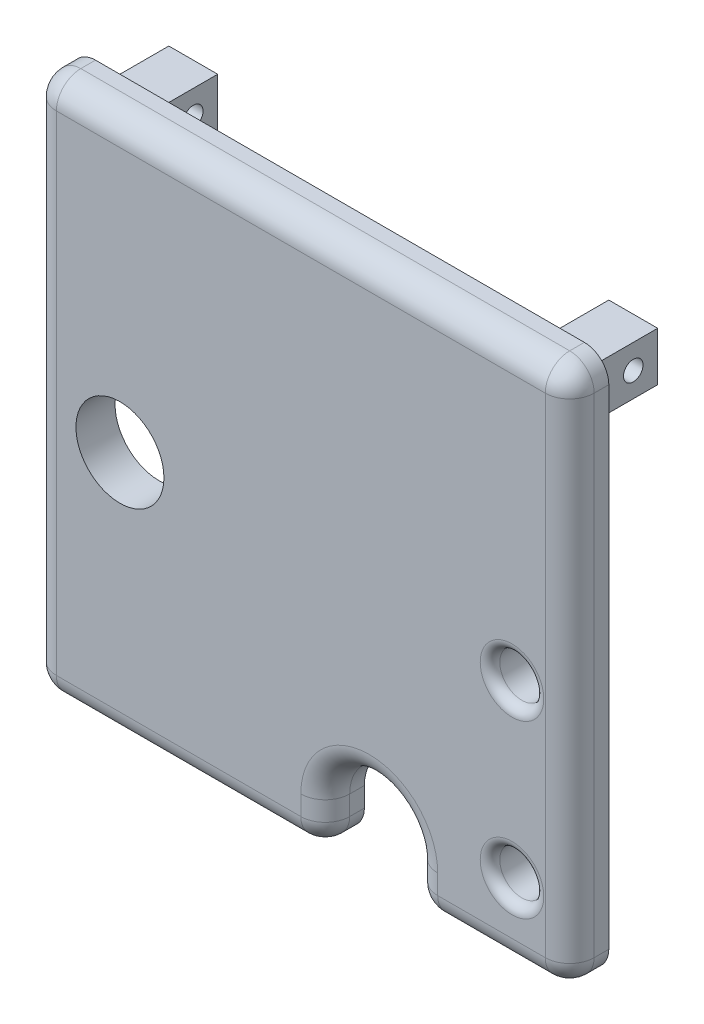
ISO-10303-21;
HEADER;
FILE_DESCRIPTION(('STEP AP214'),'2;1');
FILE_NAME('part.step','',(''),(''),'','','');
FILE_SCHEMA(('AUTOMOTIVE_DESIGN { 1 0 10303 214 1 1 1 1 }'));
ENDSEC;
DATA;
#1=APPLICATION_CONTEXT('core data for automotive mechanical design processes');
#2=APPLICATION_PROTOCOL_DEFINITION('international standard','automotive_design',2000,#1);
#3=PRODUCT_CONTEXT('',#1,'mechanical');
#4=PRODUCT('Part','Part','',(#3));
#5=PRODUCT_RELATED_PRODUCT_CATEGORY('part','',(#4));
#6=PRODUCT_DEFINITION_FORMATION('','',#4);
#7=PRODUCT_DEFINITION_CONTEXT('part definition',#1,'design');
#8=PRODUCT_DEFINITION('design','',#6,#7);
#9=PRODUCT_DEFINITION_SHAPE('','',#8);
#10=(LENGTH_UNIT() NAMED_UNIT(*) SI_UNIT(.MILLI.,.METRE.));
#11=(NAMED_UNIT(*) PLANE_ANGLE_UNIT() SI_UNIT($,.RADIAN.));
#12=(NAMED_UNIT(*) SI_UNIT($,.STERADIAN.) SOLID_ANGLE_UNIT());
#13=UNCERTAINTY_MEASURE_WITH_UNIT(LENGTH_MEASURE(1.E-05),#10,'distance_accuracy_value','');
#14=(GEOMETRIC_REPRESENTATION_CONTEXT(3) GLOBAL_UNCERTAINTY_ASSIGNED_CONTEXT((#13)) GLOBAL_UNIT_ASSIGNED_CONTEXT((#10,
#11,#12)) REPRESENTATION_CONTEXT('',''));
#15=CARTESIAN_POINT('',(0.,0.,0.));
#16=DIRECTION('',(0.,0.,1.));
#17=DIRECTION('',(1.,0.,0.));
#18=AXIS2_PLACEMENT_3D('',#15,#16,#17);
#19=CARTESIAN_POINT('',(43.2,-39.3,-15.));
#20=DIRECTION('',(0.,0.,1.));
#21=DIRECTION('',(1.,0.,0.));
#22=AXIS2_PLACEMENT_3D('',#19,#20,#21);
#23=CYLINDRICAL_SURFACE('',#22,4.5);
#24=CARTESIAN_POINT('',(43.2,-39.3,6.));
#25=DIRECTION('',(0.,0.,-1.));
#26=DIRECTION('',(-1.,0.,0.));
#27=AXIS2_PLACEMENT_3D('',#24,#25,#26);
#28=CIRCLE('',#27,4.5);
#29=CARTESIAN_POINT('',(38.7,-39.3,6.));
#30=VERTEX_POINT('',#29);
#31=EDGE_CURVE('E467',#30,#30,#28,.F.);
#32=ORIENTED_EDGE('',*,*,#31,.T.);
#33=EDGE_LOOP('',(#32));
#34=FACE_BOUND('',#33,.T.);
#35=CARTESIAN_POINT('',(43.2,-39.3,0.));
#36=DIRECTION('',(0.,0.,-1.));
#37=DIRECTION('',(-1.,0.,0.));
#38=AXIS2_PLACEMENT_3D('',#35,#36,#37);
#39=CIRCLE('',#38,4.5);
#40=CARTESIAN_POINT('',(38.7,-39.3,0.));
#41=VERTEX_POINT('',#40);
#42=EDGE_CURVE('E271',#41,#41,#39,.T.);
#43=ORIENTED_EDGE('',*,*,#42,.T.);
#44=EDGE_LOOP('',(#43));
#45=FACE_BOUND('',#44,.T.);
#46=ADVANCED_FACE('F45',(#34,#45),#23,.F.);
#47=CARTESIAN_POINT('',(-55.,-55.,8.));
#48=DIRECTION('',(0.,1.,0.));
#49=DIRECTION('',(0.,0.,1.));
#50=AXIS2_PLACEMENT_3D('',#47,#48,#49);
#51=PLANE('',#50);
#52=DIRECTION('',(1.,0.,0.));
#53=VECTOR('',#52,1.);
#54=CARTESIAN_POINT('',(-55.,-55.,0.));
#55=LINE('',#54,#53);
#56=CARTESIAN_POINT('',(28.,-55.,0.));
#57=VERTEX_POINT('',#56);
#58=CARTESIAN_POINT('',(50.,-55.,0.));
#59=VERTEX_POINT('',#58);
#60=EDGE_CURVE('E423',#57,#59,#55,.T.);
#61=ORIENTED_EDGE('',*,*,#60,.T.);
#62=DIRECTION('',(0.,0.,-1.));
#63=VECTOR('',#62,1.);
#64=CARTESIAN_POINT('',(50.,-55.,8.));
#65=LINE('',#64,#63);
#66=CARTESIAN_POINT('',(50.,-55.,3.));
#67=VERTEX_POINT('',#66);
#68=EDGE_CURVE('E63',#59,#67,#65,.F.);
#69=ORIENTED_EDGE('',*,*,#68,.T.);
#70=DIRECTION('',(1.,0.,0.));
#71=VECTOR('',#70,1.);
#72=CARTESIAN_POINT('',(-55.,-55.,3.));
#73=LINE('',#72,#71);
#74=CARTESIAN_POINT('',(28.,-55.,3.));
#75=VERTEX_POINT('',#74);
#76=EDGE_CURVE('E475',#67,#75,#73,.F.);
#77=ORIENTED_EDGE('',*,*,#76,.T.);
#78=DIRECTION('',(0.,0.,1.));
#79=VECTOR('',#78,1.);
#80=CARTESIAN_POINT('',(28.,-55.,8.));
#81=LINE('',#80,#79);
#82=EDGE_CURVE('E478',#75,#57,#81,.F.);
#83=ORIENTED_EDGE('',*,*,#82,.T.);
#84=EDGE_LOOP('',(#61,#69,#77,#83));
#85=FACE_BOUND('',#84,.T.);
#86=ADVANCED_FACE('F649',(#85),#51,.F.);
#87=CARTESIAN_POINT('',(0.,0.,0.));
#88=DIRECTION('',(0.,0.,-1.));
#89=DIRECTION('',(-1.,0.,0.));
#90=AXIS2_PLACEMENT_3D('',#87,#88,#89);
#91=PLANE('',#90);
#92=ORIENTED_EDGE('',*,*,#42,.F.);
#93=EDGE_LOOP('',(#92));
#94=FACE_BOUND('',#93,.T.);
#95=CARTESIAN_POINT('',(-37.,-4.,0.));
#96=DIRECTION('',(0.,0.,-1.));
#97=DIRECTION('',(-1.,0.,0.));
#98=AXIS2_PLACEMENT_3D('',#95,#96,#97);
#99=CIRCLE('',#98,9.);
#100=CARTESIAN_POINT('',(-46.,-4.,0.));
#101=VERTEX_POINT('',#100);
#102=EDGE_CURVE('E280',#101,#101,#99,.T.);
#103=ORIENTED_EDGE('',*,*,#102,.F.);
#104=EDGE_LOOP('',(#103));
#105=FACE_BOUND('',#104,.T.);
#106=CARTESIAN_POINT('',(-50.,-55.,0.));
#107=VERTEX_POINT('',#106);
#108=CARTESIAN_POINT('',(0.,-55.,0.));
#109=VERTEX_POINT('',#108);
#110=EDGE_CURVE('E424',#107,#109,#55,.T.);
#111=ORIENTED_EDGE('',*,*,#110,.F.);
#112=CARTESIAN_POINT('',(-50.,-50.,0.));
#113=DIRECTION('',(0.,0.,-1.));
#114=DIRECTION('',(-1.,0.,0.));
#115=AXIS2_PLACEMENT_3D('',#112,#113,#114);
#116=CIRCLE('',#115,5.);
#117=CARTESIAN_POINT('',(-55.,-50.,0.));
#118=VERTEX_POINT('',#117);
#119=EDGE_CURVE('E560',#107,#118,#116,.T.);
#120=ORIENTED_EDGE('',*,*,#119,.T.);
#121=DIRECTION('',(0.,-1.,0.));
#122=VECTOR('',#121,1.);
#123=CARTESIAN_POINT('',(-55.,-55.,0.));
#124=LINE('',#123,#122);
#125=CARTESIAN_POINT('',(-55.,50.,0.));
#126=VERTEX_POINT('',#125);
#127=EDGE_CURVE('E419',#126,#118,#124,.T.);
#128=ORIENTED_EDGE('',*,*,#127,.F.);
#129=CARTESIAN_POINT('',(-50.,50.,0.));
#130=DIRECTION('',(0.,0.,-1.));
#131=DIRECTION('',(-1.,0.,0.));
#132=AXIS2_PLACEMENT_3D('',#129,#130,#131);
#133=CIRCLE('',#132,5.);
#134=CARTESIAN_POINT('',(-50.,55.,0.));
#135=VERTEX_POINT('',#134);
#136=EDGE_CURVE('E557',#126,#135,#133,.T.);
#137=ORIENTED_EDGE('',*,*,#136,.T.);
#138=DIRECTION('',(-1.,0.,0.));
#139=VECTOR('',#138,1.);
#140=CARTESIAN_POINT('',(-55.,55.,0.));
#141=LINE('',#140,#139);
#142=CARTESIAN_POINT('',(50.,55.,0.));
#143=VERTEX_POINT('',#142);
#144=EDGE_CURVE('E415',#143,#135,#141,.T.);
#145=ORIENTED_EDGE('',*,*,#144,.F.);
#146=CARTESIAN_POINT('',(50.,50.,0.));
#147=DIRECTION('',(0.,0.,-1.));
#148=DIRECTION('',(-1.,0.,0.));
#149=AXIS2_PLACEMENT_3D('',#146,#147,#148);
#150=CIRCLE('',#149,5.);
#151=CARTESIAN_POINT('',(55.,50.,0.));
#152=VERTEX_POINT('',#151);
#153=EDGE_CURVE('E554',#143,#152,#150,.T.);
#154=ORIENTED_EDGE('',*,*,#153,.T.);
#155=DIRECTION('',(0.,1.,0.));
#156=VECTOR('',#155,1.);
#157=CARTESIAN_POINT('',(55.,-55.,0.));
#158=LINE('',#157,#156);
#159=CARTESIAN_POINT('',(55.,-50.,0.));
#160=VERTEX_POINT('',#159);
#161=EDGE_CURVE('E411',#160,#152,#158,.T.);
#162=ORIENTED_EDGE('',*,*,#161,.F.);
#163=CARTESIAN_POINT('',(50.,-50.,0.));
#164=DIRECTION('',(0.,0.,-1.));
#165=DIRECTION('',(-1.,0.,0.));
#166=AXIS2_PLACEMENT_3D('',#163,#164,#165);
#167=CIRCLE('',#166,5.);
#168=EDGE_CURVE('E551',#160,#59,#167,.T.);
#169=ORIENTED_EDGE('',*,*,#168,.T.);
#170=ORIENTED_EDGE('',*,*,#60,.F.);
#171=CARTESIAN_POINT('',(28.,-50.,0.));
#172=DIRECTION('',(0.,0.,-1.));
#173=DIRECTION('',(-1.,0.,0.));
#174=AXIS2_PLACEMENT_3D('',#171,#172,#173);
#175=CIRCLE('',#174,5.);
#176=CARTESIAN_POINT('',(23.,-50.,0.));
#177=VERTEX_POINT('',#176);
#178=EDGE_CURVE('E484',#57,#177,#175,.T.);
#179=ORIENTED_EDGE('',*,*,#178,.T.);
#180=DIRECTION('',(0.,-1.,0.));
#181=VECTOR('',#180,1.);
#182=CARTESIAN_POINT('',(23.,0.,0.));
#183=LINE('',#182,#181);
#184=CARTESIAN_POINT('',(23.,-46.,0.));
#185=VERTEX_POINT('',#184);
#186=EDGE_CURVE('E260',#185,#177,#183,.T.);
#187=ORIENTED_EDGE('',*,*,#186,.F.);
#188=CARTESIAN_POINT('',(14.,-46.,0.));
#189=DIRECTION('',(0.,0.,-1.));
#190=DIRECTION('',(-1.,0.,0.));
#191=AXIS2_PLACEMENT_3D('',#188,#189,#190);
#192=CIRCLE('',#191,9.);
#193=CARTESIAN_POINT('',(5.00000000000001,-46.,0.));
#194=VERTEX_POINT('',#193);
#195=EDGE_CURVE('E266',#194,#185,#192,.T.);
#196=ORIENTED_EDGE('',*,*,#195,.F.);
#197=DIRECTION('',(0.,1.,0.));
#198=VECTOR('',#197,1.);
#199=CARTESIAN_POINT('',(5.00000000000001,0.,0.));
#200=LINE('',#199,#198);
#201=CARTESIAN_POINT('',(5.00000000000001,-50.,0.));
#202=VERTEX_POINT('',#201);
#203=EDGE_CURVE('E247',#202,#194,#200,.T.);
#204=ORIENTED_EDGE('',*,*,#203,.F.);
#205=CARTESIAN_POINT('',(0.,-50.,0.));
#206=DIRECTION('',(0.,0.,-1.));
#207=DIRECTION('',(-1.,0.,0.));
#208=AXIS2_PLACEMENT_3D('',#205,#206,#207);
#209=CIRCLE('',#208,5.);
#210=EDGE_CURVE('E481',#202,#109,#209,.T.);
#211=ORIENTED_EDGE('',*,*,#210,.T.);
#212=EDGE_LOOP('',(#111,#120,#128,#137,#145,#154,#162,#169,#170,#179,#187,#196,#204,#211));
#213=FACE_BOUND('',#212,.T.);
#214=CARTESIAN_POINT('',(43.2,-4.3,0.));
#215=DIRECTION('',(0.,0.,-1.));
#216=DIRECTION('',(-1.,0.,0.));
#217=AXIS2_PLACEMENT_3D('',#214,#215,#216);
#218=CIRCLE('',#217,4.5);
#219=CARTESIAN_POINT('',(38.7,-4.3,0.));
#220=VERTEX_POINT('',#219);
#221=EDGE_CURVE('E261',#220,#220,#218,.T.);
#222=ORIENTED_EDGE('',*,*,#221,.F.);
#223=EDGE_LOOP('',(#222));
#224=FACE_BOUND('',#223,.T.);
#225=DIRECTION('',(1.,0.,0.));
#226=VECTOR('',#225,1.);
#227=CARTESIAN_POINT('',(50.,50.,0.));
#228=LINE('',#227,#226);
#229=CARTESIAN_POINT('',(40.,50.,0.));
#230=VERTEX_POINT('',#229);
#231=CARTESIAN_POINT('',(50.,50.,0.));
#232=VERTEX_POINT('',#231);
#233=EDGE_CURVE('E389',#230,#232,#228,.T.);
#234=ORIENTED_EDGE('',*,*,#233,.F.);
#235=DIRECTION('',(0.,1.,0.));
#236=VECTOR('',#235,1.);
#237=CARTESIAN_POINT('',(40.,50.,0.));
#238=LINE('',#237,#236);
#239=CARTESIAN_POINT('',(40.,40.,0.));
#240=VERTEX_POINT('',#239);
#241=EDGE_CURVE('E359',#240,#230,#238,.T.);
#242=ORIENTED_EDGE('',*,*,#241,.F.);
#243=DIRECTION('',(-1.,0.,0.));
#244=VECTOR('',#243,1.);
#245=CARTESIAN_POINT('',(50.,40.,0.));
#246=LINE('',#245,#244);
#247=CARTESIAN_POINT('',(50.,40.,0.));
#248=VERTEX_POINT('',#247);
#249=EDGE_CURVE('E376',#248,#240,#246,.T.);
#250=ORIENTED_EDGE('',*,*,#249,.F.);
#251=DIRECTION('',(0.,-1.,0.));
#252=VECTOR('',#251,1.);
#253=CARTESIAN_POINT('',(50.,50.,0.));
#254=LINE('',#253,#252);
#255=EDGE_CURVE('E392',#232,#248,#254,.T.);
#256=ORIENTED_EDGE('',*,*,#255,.F.);
#257=EDGE_LOOP('',(#234,#242,#250,#256));
#258=FACE_BOUND('',#257,.T.);
#259=DIRECTION('',(0.,-1.,0.));
#260=VECTOR('',#259,1.);
#261=CARTESIAN_POINT('',(-40.,50.,0.));
#262=LINE('',#261,#260);
#263=CARTESIAN_POINT('',(-40.,50.,0.));
#264=VERTEX_POINT('',#263);
#265=CARTESIAN_POINT('',(-40.,40.,0.));
#266=VERTEX_POINT('',#265);
#267=EDGE_CURVE('E352',#264,#266,#262,.T.);
#268=ORIENTED_EDGE('',*,*,#267,.F.);
#269=DIRECTION('',(1.,0.,0.));
#270=VECTOR('',#269,1.);
#271=CARTESIAN_POINT('',(-50.,50.,0.));
#272=LINE('',#271,#270);
#273=CARTESIAN_POINT('',(-50.,50.,0.));
#274=VERTEX_POINT('',#273);
#275=EDGE_CURVE('E355',#274,#264,#272,.T.);
#276=ORIENTED_EDGE('',*,*,#275,.F.);
#277=DIRECTION('',(0.,1.,0.));
#278=VECTOR('',#277,1.);
#279=CARTESIAN_POINT('',(-50.,50.,0.));
#280=LINE('',#279,#278);
#281=CARTESIAN_POINT('',(-50.,40.,0.));
#282=VERTEX_POINT('',#281);
#283=EDGE_CURVE('E344',#282,#274,#280,.T.);
#284=ORIENTED_EDGE('',*,*,#283,.F.);
#285=DIRECTION('',(-1.,0.,0.));
#286=VECTOR('',#285,1.);
#287=CARTESIAN_POINT('',(-50.,40.,0.));
#288=LINE('',#287,#286);
#289=EDGE_CURVE('E347',#266,#282,#288,.T.);
#290=ORIENTED_EDGE('',*,*,#289,.F.);
#291=EDGE_LOOP('',(#268,#276,#284,#290));
#292=FACE_BOUND('',#291,.T.);
#293=DIRECTION('',(1.,0.,0.));
#294=VECTOR('',#293,1.);
#295=CARTESIAN_POINT('',(-50.,-40.,0.));
#296=LINE('',#295,#294);
#297=CARTESIAN_POINT('',(-50.,-40.,0.));
#298=VERTEX_POINT('',#297);
#299=CARTESIAN_POINT('',(-40.,-40.,0.));
#300=VERTEX_POINT('',#299);
#301=EDGE_CURVE('E311',#298,#300,#296,.T.);
#302=ORIENTED_EDGE('',*,*,#301,.F.);
#303=DIRECTION('',(0.,1.,0.));
#304=VECTOR('',#303,1.);
#305=CARTESIAN_POINT('',(-50.,-50.,0.));
#306=LINE('',#305,#304);
#307=CARTESIAN_POINT('',(-50.,-50.,0.));
#308=VERTEX_POINT('',#307);
#309=EDGE_CURVE('E314',#308,#298,#306,.T.);
#310=ORIENTED_EDGE('',*,*,#309,.F.);
#311=DIRECTION('',(-1.,0.,0.));
#312=VECTOR('',#311,1.);
#313=CARTESIAN_POINT('',(-50.,-50.,0.));
#314=LINE('',#313,#312);
#315=CARTESIAN_POINT('',(-40.,-50.,0.));
#316=VERTEX_POINT('',#315);
#317=EDGE_CURVE('E303',#316,#308,#314,.T.);
#318=ORIENTED_EDGE('',*,*,#317,.F.);
#319=DIRECTION('',(0.,-1.,0.));
#320=VECTOR('',#319,1.);
#321=CARTESIAN_POINT('',(-40.,-50.,0.));
#322=LINE('',#321,#320);
#323=EDGE_CURVE('E306',#300,#316,#322,.T.);
#324=ORIENTED_EDGE('',*,*,#323,.F.);
#325=EDGE_LOOP('',(#302,#310,#318,#324));
#326=FACE_BOUND('',#325,.T.);
#327=ADVANCED_FACE('F276',(#94,#105,#213,#224,#258,#292,#326),#91,.T.);
#328=CARTESIAN_POINT('',(55.,-55.,8.));
#329=DIRECTION('',(-1.,0.,0.));
#330=DIRECTION('',(0.,0.,1.));
#331=AXIS2_PLACEMENT_3D('',#328,#329,#330);
#332=PLANE('',#331);
#333=ORIENTED_EDGE('',*,*,#161,.T.);
#334=DIRECTION('',(0.,0.,-1.));
#335=VECTOR('',#334,1.);
#336=CARTESIAN_POINT('',(55.,50.,8.));
#337=LINE('',#336,#335);
#338=CARTESIAN_POINT('',(55.,50.,3.));
#339=VERTEX_POINT('',#338);
#340=EDGE_CURVE('E581',#152,#339,#337,.F.);
#341=ORIENTED_EDGE('',*,*,#340,.T.);
#342=DIRECTION('',(0.,1.,0.));
#343=VECTOR('',#342,1.);
#344=CARTESIAN_POINT('',(55.,-55.,3.));
#345=LINE('',#344,#343);
#346=CARTESIAN_POINT('',(55.,-50.,3.));
#347=VERTEX_POINT('',#346);
#348=EDGE_CURVE('E521',#339,#347,#345,.F.);
#349=ORIENTED_EDGE('',*,*,#348,.T.);
#350=DIRECTION('',(0.,0.,-1.));
#351=VECTOR('',#350,1.);
#352=CARTESIAN_POINT('',(55.,-50.,8.));
#353=LINE('',#352,#351);
#354=EDGE_CURVE('E577',#347,#160,#353,.T.);
#355=ORIENTED_EDGE('',*,*,#354,.T.);
#356=EDGE_LOOP('',(#333,#341,#349,#355));
#357=FACE_BOUND('',#356,.T.);
#358=ADVANCED_FACE('F648',(#357),#332,.F.);
#359=CARTESIAN_POINT('',(-55.,55.,8.));
#360=DIRECTION('',(0.,-1.,0.));
#361=DIRECTION('',(0.,0.,-1.));
#362=AXIS2_PLACEMENT_3D('',#359,#360,#361);
#363=PLANE('',#362);
#364=ORIENTED_EDGE('',*,*,#144,.T.);
#365=DIRECTION('',(0.,0.,-1.));
#366=VECTOR('',#365,1.);
#367=CARTESIAN_POINT('',(-50.,55.,8.));
#368=LINE('',#367,#366);
#369=CARTESIAN_POINT('',(-50.,55.,3.));
#370=VERTEX_POINT('',#369);
#371=EDGE_CURVE('E574',#135,#370,#368,.F.);
#372=ORIENTED_EDGE('',*,*,#371,.T.);
#373=DIRECTION('',(-1.,0.,0.));
#374=VECTOR('',#373,1.);
#375=CARTESIAN_POINT('',(-55.,55.,3.));
#376=LINE('',#375,#374);
#377=CARTESIAN_POINT('',(50.,55.,3.));
#378=VERTEX_POINT('',#377);
#379=EDGE_CURVE('E524',#370,#378,#376,.F.);
#380=ORIENTED_EDGE('',*,*,#379,.T.);
#381=DIRECTION('',(0.,0.,-1.));
#382=VECTOR('',#381,1.);
#383=CARTESIAN_POINT('',(50.,55.,8.));
#384=LINE('',#383,#382);
#385=EDGE_CURVE('E570',#378,#143,#384,.T.);
#386=ORIENTED_EDGE('',*,*,#385,.T.);
#387=EDGE_LOOP('',(#364,#372,#380,#386));
#388=FACE_BOUND('',#387,.T.);
#389=ADVANCED_FACE('F779',(#388),#363,.F.);
#390=CARTESIAN_POINT('',(-55.,-55.,8.));
#391=DIRECTION('',(1.,0.,0.));
#392=DIRECTION('',(0.,0.,-1.));
#393=AXIS2_PLACEMENT_3D('',#390,#391,#392);
#394=PLANE('',#393);
#395=ORIENTED_EDGE('',*,*,#127,.T.);
#396=DIRECTION('',(0.,0.,-1.));
#397=VECTOR('',#396,1.);
#398=CARTESIAN_POINT('',(-55.,-50.,8.));
#399=LINE('',#398,#397);
#400=CARTESIAN_POINT('',(-55.,-50.,3.));
#401=VERTEX_POINT('',#400);
#402=EDGE_CURVE('E567',#118,#401,#399,.F.);
#403=ORIENTED_EDGE('',*,*,#402,.T.);
#404=DIRECTION('',(0.,-1.,0.));
#405=VECTOR('',#404,1.);
#406=CARTESIAN_POINT('',(-55.,-55.,3.));
#407=LINE('',#406,#405);
#408=CARTESIAN_POINT('',(-55.,50.,3.));
#409=VERTEX_POINT('',#408);
#410=EDGE_CURVE('E528',#401,#409,#407,.F.);
#411=ORIENTED_EDGE('',*,*,#410,.T.);
#412=DIRECTION('',(0.,0.,-1.));
#413=VECTOR('',#412,1.);
#414=CARTESIAN_POINT('',(-55.,50.,8.));
#415=LINE('',#414,#413);
#416=EDGE_CURVE('E563',#409,#126,#415,.T.);
#417=ORIENTED_EDGE('',*,*,#416,.T.);
#418=EDGE_LOOP('',(#395,#403,#411,#417));
#419=FACE_BOUND('',#418,.T.);
#420=ADVANCED_FACE('F787',(#419),#394,.F.);
#421=DIRECTION('',(1.,0.,0.));
#422=VECTOR('',#421,1.);
#423=CARTESIAN_POINT('',(-55.,-55.,3.));
#424=LINE('',#423,#422);
#425=CARTESIAN_POINT('',(0.,-55.,3.));
#426=VERTEX_POINT('',#425);
#427=CARTESIAN_POINT('',(-50.,-55.,3.));
#428=VERTEX_POINT('',#427);
#429=EDGE_CURVE('E490',#426,#428,#424,.F.);
#430=ORIENTED_EDGE('',*,*,#429,.T.);
#431=DIRECTION('',(0.,0.,-1.));
#432=VECTOR('',#431,1.);
#433=CARTESIAN_POINT('',(-50.,-55.,8.));
#434=LINE('',#433,#432);
#435=EDGE_CURVE('E532',#428,#107,#434,.T.);
#436=ORIENTED_EDGE('',*,*,#435,.T.);
#437=ORIENTED_EDGE('',*,*,#110,.T.);
#438=DIRECTION('',(0.,0.,1.));
#439=VECTOR('',#438,1.);
#440=CARTESIAN_POINT('',(0.,-55.,8.));
#441=LINE('',#440,#439);
#442=EDGE_CURVE('E494',#109,#426,#441,.T.);
#443=ORIENTED_EDGE('',*,*,#442,.T.);
#444=EDGE_LOOP('',(#430,#436,#437,#443));
#445=FACE_BOUND('',#444,.T.);
#446=ADVANCED_FACE('F697',(#445),#51,.F.);
#447=CARTESIAN_POINT('',(0.,0.,8.));
#448=DIRECTION('',(0.,0.,-1.));
#449=DIRECTION('',(-1.,0.,0.));
#450=AXIS2_PLACEMENT_3D('',#447,#448,#449);
#451=PLANE('',#450);
#452=CARTESIAN_POINT('',(43.2,-4.3,8.));
#453=DIRECTION('',(0.,0.,-1.));
#454=DIRECTION('',(-1.,0.,0.));
#455=AXIS2_PLACEMENT_3D('',#452,#453,#454);
#456=CIRCLE('',#455,6.5);
#457=CARTESIAN_POINT('',(36.7,-4.3,8.));
#458=VERTEX_POINT('',#457);
#459=EDGE_CURVE('E463',#458,#458,#456,.T.);
#460=ORIENTED_EDGE('',*,*,#459,.T.);
#461=EDGE_LOOP('',(#460));
#462=FACE_BOUND('',#461,.T.);
#463=CARTESIAN_POINT('',(43.2,-39.3,8.));
#464=DIRECTION('',(0.,0.,-1.));
#465=DIRECTION('',(-1.,0.,0.));
#466=AXIS2_PLACEMENT_3D('',#463,#464,#465);
#467=CIRCLE('',#466,6.5);
#468=CARTESIAN_POINT('',(36.7,-39.3,8.));
#469=VERTEX_POINT('',#468);
#470=EDGE_CURVE('E459',#469,#469,#467,.T.);
#471=ORIENTED_EDGE('',*,*,#470,.T.);
#472=EDGE_LOOP('',(#471));
#473=FACE_BOUND('',#472,.T.);
#474=CARTESIAN_POINT('',(-37.,-4.,8.));
#475=DIRECTION('',(0.,0.,1.));
#476=DIRECTION('',(1.,0.,0.));
#477=AXIS2_PLACEMENT_3D('',#474,#475,#476);
#478=CIRCLE('',#477,9.);
#479=CARTESIAN_POINT('',(-28.,-4.,8.));
#480=VERTEX_POINT('',#479);
#481=EDGE_CURVE('E455',#480,#480,#478,.T.);
#482=ORIENTED_EDGE('',*,*,#481,.F.);
#483=EDGE_LOOP('',(#482));
#484=FACE_BOUND('',#483,.T.);
#485=DIRECTION('',(0.,1.,0.));
#486=VECTOR('',#485,1.);
#487=CARTESIAN_POINT('',(28.,0.,8.));
#488=LINE('',#487,#486);
#489=CARTESIAN_POINT('',(28.,-46.,8.));
#490=VERTEX_POINT('',#489);
#491=CARTESIAN_POINT('',(28.,-50.,8.));
#492=VERTEX_POINT('',#491);
#493=EDGE_CURVE('E430',#490,#492,#488,.F.);
#494=ORIENTED_EDGE('',*,*,#493,.T.);
#495=DIRECTION('',(1.,0.,0.));
#496=VECTOR('',#495,1.);
#497=CARTESIAN_POINT('',(0.,-50.,8.));
#498=LINE('',#497,#496);
#499=CARTESIAN_POINT('',(50.,-50.,8.));
#500=VERTEX_POINT('',#499);
#501=EDGE_CURVE('E517',#492,#500,#498,.T.);
#502=ORIENTED_EDGE('',*,*,#501,.T.);
#503=DIRECTION('',(0.,1.,0.));
#504=VECTOR('',#503,1.);
#505=CARTESIAN_POINT('',(50.,0.,8.));
#506=LINE('',#505,#504);
#507=CARTESIAN_POINT('',(50.,50.,8.));
#508=VERTEX_POINT('',#507);
#509=EDGE_CURVE('E513',#500,#508,#506,.T.);
#510=ORIENTED_EDGE('',*,*,#509,.T.);
#511=DIRECTION('',(-1.,0.,0.));
#512=VECTOR('',#511,1.);
#513=CARTESIAN_POINT('',(0.,50.,8.));
#514=LINE('',#513,#512);
#515=CARTESIAN_POINT('',(-50.,50.,8.));
#516=VERTEX_POINT('',#515);
#517=EDGE_CURVE('E509',#508,#516,#514,.T.);
#518=ORIENTED_EDGE('',*,*,#517,.T.);
#519=DIRECTION('',(0.,-1.,0.));
#520=VECTOR('',#519,1.);
#521=CARTESIAN_POINT('',(-50.,0.,8.));
#522=LINE('',#521,#520);
#523=CARTESIAN_POINT('',(-50.,-50.,8.));
#524=VERTEX_POINT('',#523);
#525=EDGE_CURVE('E505',#516,#524,#522,.T.);
#526=ORIENTED_EDGE('',*,*,#525,.T.);
#527=DIRECTION('',(1.,0.,0.));
#528=VECTOR('',#527,1.);
#529=CARTESIAN_POINT('',(0.,-50.,8.));
#530=LINE('',#529,#528);
#531=CARTESIAN_POINT('',(0.,-50.,8.));
#532=VERTEX_POINT('',#531);
#533=EDGE_CURVE('E502',#524,#532,#530,.T.);
#534=ORIENTED_EDGE('',*,*,#533,.T.);
#535=DIRECTION('',(0.,-1.,0.));
#536=VECTOR('',#535,1.);
#537=CARTESIAN_POINT('',(0.,0.,8.));
#538=LINE('',#537,#536);
#539=CARTESIAN_POINT('',(0.,-46.,8.));
#540=VERTEX_POINT('',#539);
#541=EDGE_CURVE('E437',#532,#540,#538,.F.);
#542=ORIENTED_EDGE('',*,*,#541,.T.);
#543=CARTESIAN_POINT('',(14.,-46.,8.));
#544=DIRECTION('',(0.,0.,-1.));
#545=DIRECTION('',(-1.,0.,0.));
#546=AXIS2_PLACEMENT_3D('',#543,#544,#545);
#547=CIRCLE('',#546,14.);
#548=EDGE_CURVE('E434',#540,#490,#547,.T.);
#549=ORIENTED_EDGE('',*,*,#548,.T.);
#550=EDGE_LOOP('',(#494,#502,#510,#518,#526,#534,#542,#549));
#551=FACE_BOUND('',#550,.T.);
#552=ADVANCED_FACE('F802',(#462,#473,#484,#551),#451,.F.);
#553=CARTESIAN_POINT('',(40.,50.,-15.));
#554=DIRECTION('',(1.,0.,0.));
#555=DIRECTION('',(0.,0.,-1.));
#556=AXIS2_PLACEMENT_3D('',#553,#554,#555);
#557=PLANE('',#556);
#558=CARTESIAN_POINT('',(40.,45.,-10.));
#559=DIRECTION('',(1.,0.,0.));
#560=DIRECTION('',(0.,0.,-1.));
#561=AXIS2_PLACEMENT_3D('',#558,#559,#560);
#562=CIRCLE('',#561,2.);
#563=CARTESIAN_POINT('',(40.,45.,-12.));
#564=VERTEX_POINT('',#563);
#565=EDGE_CURVE('E618',#564,#564,#562,.T.);
#566=ORIENTED_EDGE('',*,*,#565,.T.);
#567=EDGE_LOOP('',(#566));
#568=FACE_BOUND('',#567,.T.);
#569=ORIENTED_EDGE('',*,*,#241,.T.);
#570=DIRECTION('',(0.,0.,1.));
#571=VECTOR('',#570,1.);
#572=CARTESIAN_POINT('',(40.,50.,-15.));
#573=LINE('',#572,#571);
#574=CARTESIAN_POINT('',(40.,50.,-15.));
#575=VERTEX_POINT('',#574);
#576=EDGE_CURVE('E408',#575,#230,#573,.T.);
#577=ORIENTED_EDGE('',*,*,#576,.F.);
#578=DIRECTION('',(0.,1.,0.));
#579=VECTOR('',#578,1.);
#580=CARTESIAN_POINT('',(40.,50.,-15.));
#581=LINE('',#580,#579);
#582=CARTESIAN_POINT('',(40.,40.,-15.));
#583=VERTEX_POINT('',#582);
#584=EDGE_CURVE('E371',#583,#575,#581,.T.);
#585=ORIENTED_EDGE('',*,*,#584,.F.);
#586=DIRECTION('',(0.,0.,1.));
#587=VECTOR('',#586,1.);
#588=CARTESIAN_POINT('',(40.,40.,-15.));
#589=LINE('',#588,#587);
#590=EDGE_CURVE('E385',#583,#240,#589,.T.);
#591=ORIENTED_EDGE('',*,*,#590,.T.);
#592=EDGE_LOOP('',(#569,#577,#585,#591));
#593=FACE_BOUND('',#592,.T.);
#594=ADVANCED_FACE('F809',(#568,#593),#557,.F.);
#595=CARTESIAN_POINT('',(50.,50.,-15.));
#596=DIRECTION('',(0.,-1.,0.));
#597=DIRECTION('',(0.,0.,-1.));
#598=AXIS2_PLACEMENT_3D('',#595,#596,#597);
#599=PLANE('',#598);
#600=ORIENTED_EDGE('',*,*,#233,.T.);
#601=DIRECTION('',(0.,0.,1.));
#602=VECTOR('',#601,1.);
#603=CARTESIAN_POINT('',(50.,50.,-15.));
#604=LINE('',#603,#602);
#605=CARTESIAN_POINT('',(50.,50.,-15.));
#606=VERTEX_POINT('',#605);
#607=EDGE_CURVE('E404',#606,#232,#604,.T.);
#608=ORIENTED_EDGE('',*,*,#607,.F.);
#609=DIRECTION('',(1.,0.,0.));
#610=VECTOR('',#609,1.);
#611=CARTESIAN_POINT('',(50.,50.,-15.));
#612=LINE('',#611,#610);
#613=EDGE_CURVE('E375',#575,#606,#612,.T.);
#614=ORIENTED_EDGE('',*,*,#613,.F.);
#615=ORIENTED_EDGE('',*,*,#576,.T.);
#616=EDGE_LOOP('',(#600,#608,#614,#615));
#617=FACE_BOUND('',#616,.T.);
#618=ADVANCED_FACE('F818',(#617),#599,.F.);
#619=CARTESIAN_POINT('',(50.,50.,-15.));
#620=DIRECTION('',(-1.,0.,0.));
#621=DIRECTION('',(0.,0.,1.));
#622=AXIS2_PLACEMENT_3D('',#619,#620,#621);
#623=PLANE('',#622);
#624=CARTESIAN_POINT('',(50.,45.,-10.));
#625=DIRECTION('',(1.,0.,0.));
#626=DIRECTION('',(0.,0.,-1.));
#627=AXIS2_PLACEMENT_3D('',#624,#625,#626);
#628=CIRCLE('',#627,2.);
#629=CARTESIAN_POINT('',(50.,45.,-12.));
#630=VERTEX_POINT('',#629);
#631=EDGE_CURVE('E1379',#630,#630,#628,.T.);
#632=ORIENTED_EDGE('',*,*,#631,.F.);
#633=EDGE_LOOP('',(#632));
#634=FACE_BOUND('',#633,.T.);
#635=ORIENTED_EDGE('',*,*,#255,.T.);
#636=DIRECTION('',(0.,0.,1.));
#637=VECTOR('',#636,1.);
#638=CARTESIAN_POINT('',(50.,40.,-15.));
#639=LINE('',#638,#637);
#640=CARTESIAN_POINT('',(50.,40.,-15.));
#641=VERTEX_POINT('',#640);
#642=EDGE_CURVE('E401',#641,#248,#639,.T.);
#643=ORIENTED_EDGE('',*,*,#642,.F.);
#644=DIRECTION('',(0.,-1.,0.));
#645=VECTOR('',#644,1.);
#646=CARTESIAN_POINT('',(50.,50.,-15.));
#647=LINE('',#646,#645);
#648=EDGE_CURVE('E379',#606,#641,#647,.T.);
#649=ORIENTED_EDGE('',*,*,#648,.F.);
#650=ORIENTED_EDGE('',*,*,#607,.T.);
#651=EDGE_LOOP('',(#635,#643,#649,#650));
#652=FACE_BOUND('',#651,.T.);
#653=ADVANCED_FACE('F827',(#634,#652),#623,.F.);
#654=CARTESIAN_POINT('',(50.,40.,-15.));
#655=DIRECTION('',(0.,1.,0.));
#656=DIRECTION('',(0.,0.,1.));
#657=AXIS2_PLACEMENT_3D('',#654,#655,#656);
#658=PLANE('',#657);
#659=ORIENTED_EDGE('',*,*,#249,.T.);
#660=ORIENTED_EDGE('',*,*,#590,.F.);
#661=DIRECTION('',(-1.,0.,0.));
#662=VECTOR('',#661,1.);
#663=CARTESIAN_POINT('',(50.,40.,-15.));
#664=LINE('',#663,#662);
#665=EDGE_CURVE('E382',#641,#583,#664,.T.);
#666=ORIENTED_EDGE('',*,*,#665,.F.);
#667=ORIENTED_EDGE('',*,*,#642,.T.);
#668=EDGE_LOOP('',(#659,#660,#666,#667));
#669=FACE_BOUND('',#668,.T.);
#670=ADVANCED_FACE('F835',(#669),#658,.F.);
#671=CARTESIAN_POINT('',(0.,0.,-15.));
#672=DIRECTION('',(0.,0.,-1.));
#673=DIRECTION('',(-1.,0.,0.));
#674=AXIS2_PLACEMENT_3D('',#671,#672,#673);
#675=PLANE('',#674);
#676=ORIENTED_EDGE('',*,*,#584,.T.);
#677=ORIENTED_EDGE('',*,*,#613,.T.);
#678=ORIENTED_EDGE('',*,*,#648,.T.);
#679=ORIENTED_EDGE('',*,*,#665,.T.);
#680=EDGE_LOOP('',(#676,#677,#678,#679));
#681=FACE_BOUND('',#680,.T.);
#682=ADVANCED_FACE('F843',(#681),#675,.T.);
#683=CARTESIAN_POINT('',(-50.,50.,-15.));
#684=DIRECTION('',(0.,-1.,0.));
#685=DIRECTION('',(0.,0.,-1.));
#686=AXIS2_PLACEMENT_3D('',#683,#684,#685);
#687=PLANE('',#686);
#688=ORIENTED_EDGE('',*,*,#275,.T.);
#689=DIRECTION('',(0.,0.,1.));
#690=VECTOR('',#689,1.);
#691=CARTESIAN_POINT('',(-40.,50.,-15.));
#692=LINE('',#691,#690);
#693=CARTESIAN_POINT('',(-40.,50.,-15.));
#694=VERTEX_POINT('',#693);
#695=EDGE_CURVE('E318',#694,#264,#692,.T.);
#696=ORIENTED_EDGE('',*,*,#695,.F.);
#697=DIRECTION('',(1.,0.,0.));
#698=VECTOR('',#697,1.);
#699=CARTESIAN_POINT('',(-50.,50.,-15.));
#700=LINE('',#699,#698);
#701=CARTESIAN_POINT('',(-50.,50.,-15.));
#702=VERTEX_POINT('',#701);
#703=EDGE_CURVE('E348',#702,#694,#700,.T.);
#704=ORIENTED_EDGE('',*,*,#703,.F.);
#705=DIRECTION('',(0.,0.,1.));
#706=VECTOR('',#705,1.);
#707=CARTESIAN_POINT('',(-50.,50.,-15.));
#708=LINE('',#707,#706);
#709=EDGE_CURVE('E339',#702,#274,#708,.T.);
#710=ORIENTED_EDGE('',*,*,#709,.T.);
#711=EDGE_LOOP('',(#688,#696,#704,#710));
#712=FACE_BOUND('',#711,.T.);
#713=ADVANCED_FACE('F851',(#712),#687,.F.);
#714=CARTESIAN_POINT('',(-40.,50.,-15.));
#715=DIRECTION('',(-1.,0.,0.));
#716=DIRECTION('',(0.,0.,1.));
#717=AXIS2_PLACEMENT_3D('',#714,#715,#716);
#718=PLANE('',#717);
#719=CARTESIAN_POINT('',(-40.,45.,-10.));
#720=DIRECTION('',(-1.,0.,0.));
#721=DIRECTION('',(0.,0.,1.));
#722=AXIS2_PLACEMENT_3D('',#719,#720,#721);
#723=CIRCLE('',#722,2.);
#724=CARTESIAN_POINT('',(-40.,45.,-8.));
#725=VERTEX_POINT('',#724);
#726=EDGE_CURVE('E624',#725,#725,#723,.T.);
#727=ORIENTED_EDGE('',*,*,#726,.T.);
#728=EDGE_LOOP('',(#727));
#729=FACE_BOUND('',#728,.T.);
#730=ORIENTED_EDGE('',*,*,#267,.T.);
#731=DIRECTION('',(0.,0.,1.));
#732=VECTOR('',#731,1.);
#733=CARTESIAN_POINT('',(-40.,40.,-15.));
#734=LINE('',#733,#732);
#735=CARTESIAN_POINT('',(-40.,40.,-15.));
#736=VERTEX_POINT('',#735);
#737=EDGE_CURVE('E332',#736,#266,#734,.T.);
#738=ORIENTED_EDGE('',*,*,#737,.F.);
#739=DIRECTION('',(0.,-1.,0.));
#740=VECTOR('',#739,1.);
#741=CARTESIAN_POINT('',(-40.,50.,-15.));
#742=LINE('',#741,#740);
#743=EDGE_CURVE('E365',#694,#736,#742,.T.);
#744=ORIENTED_EDGE('',*,*,#743,.F.);
#745=ORIENTED_EDGE('',*,*,#695,.T.);
#746=EDGE_LOOP('',(#730,#738,#744,#745));
#747=FACE_BOUND('',#746,.T.);
#748=ADVANCED_FACE('F859',(#729,#747),#718,.F.);
#749=CARTESIAN_POINT('',(-50.,40.,-15.));
#750=DIRECTION('',(0.,1.,0.));
#751=DIRECTION('',(0.,0.,1.));
#752=AXIS2_PLACEMENT_3D('',#749,#750,#751);
#753=PLANE('',#752);
#754=ORIENTED_EDGE('',*,*,#289,.T.);
#755=DIRECTION('',(0.,0.,1.));
#756=VECTOR('',#755,1.);
#757=CARTESIAN_POINT('',(-50.,40.,-15.));
#758=LINE('',#757,#756);
#759=CARTESIAN_POINT('',(-50.,40.,-15.));
#760=VERTEX_POINT('',#759);
#761=EDGE_CURVE('E336',#760,#282,#758,.T.);
#762=ORIENTED_EDGE('',*,*,#761,.F.);
#763=DIRECTION('',(-1.,0.,0.));
#764=VECTOR('',#763,1.);
#765=CARTESIAN_POINT('',(-50.,40.,-15.));
#766=LINE('',#765,#764);
#767=EDGE_CURVE('E362',#736,#760,#766,.T.);
#768=ORIENTED_EDGE('',*,*,#767,.F.);
#769=ORIENTED_EDGE('',*,*,#737,.T.);
#770=EDGE_LOOP('',(#754,#762,#768,#769));
#771=FACE_BOUND('',#770,.T.);
#772=ADVANCED_FACE('F867',(#771),#753,.F.);
#773=CARTESIAN_POINT('',(-50.,50.,-15.));
#774=DIRECTION('',(1.,0.,0.));
#775=DIRECTION('',(0.,0.,-1.));
#776=AXIS2_PLACEMENT_3D('',#773,#774,#775);
#777=PLANE('',#776);
#778=CARTESIAN_POINT('',(-50.,45.,-10.));
#779=DIRECTION('',(1.,0.,0.));
#780=DIRECTION('',(0.,0.,-1.));
#781=AXIS2_PLACEMENT_3D('',#778,#779,#780);
#782=CIRCLE('',#781,2.);
#783=CARTESIAN_POINT('',(-50.,45.,-12.));
#784=VERTEX_POINT('',#783);
#785=EDGE_CURVE('E49',#784,#784,#782,.T.);
#786=ORIENTED_EDGE('',*,*,#785,.T.);
#787=EDGE_LOOP('',(#786));
#788=FACE_BOUND('',#787,.T.);
#789=ORIENTED_EDGE('',*,*,#283,.T.);
#790=ORIENTED_EDGE('',*,*,#709,.F.);
#791=DIRECTION('',(0.,1.,0.));
#792=VECTOR('',#791,1.);
#793=CARTESIAN_POINT('',(-50.,50.,-15.));
#794=LINE('',#793,#792);
#795=EDGE_CURVE('E343',#760,#702,#794,.T.);
#796=ORIENTED_EDGE('',*,*,#795,.F.);
#797=ORIENTED_EDGE('',*,*,#761,.T.);
#798=EDGE_LOOP('',(#789,#790,#796,#797));
#799=FACE_BOUND('',#798,.T.);
#800=ADVANCED_FACE('F874',(#788,#799),#777,.F.);
#801=CARTESIAN_POINT('',(0.,0.,-15.));
#802=DIRECTION('',(0.,0.,-1.));
#803=DIRECTION('',(-1.,0.,0.));
#804=AXIS2_PLACEMENT_3D('',#801,#802,#803);
#805=PLANE('',#804);
#806=ORIENTED_EDGE('',*,*,#703,.T.);
#807=ORIENTED_EDGE('',*,*,#743,.T.);
#808=ORIENTED_EDGE('',*,*,#767,.T.);
#809=ORIENTED_EDGE('',*,*,#795,.T.);
#810=EDGE_LOOP('',(#806,#807,#808,#809));
#811=FACE_BOUND('',#810,.T.);
#812=ADVANCED_FACE('F705',(#811),#805,.T.);
#813=CARTESIAN_POINT('',(-50.,-50.,-15.));
#814=DIRECTION('',(1.,0.,0.));
#815=DIRECTION('',(0.,0.,-1.));
#816=AXIS2_PLACEMENT_3D('',#813,#814,#815);
#817=PLANE('',#816);
#818=CARTESIAN_POINT('',(-50.,-45.,-10.));
#819=DIRECTION('',(1.,0.,0.));
#820=DIRECTION('',(0.,0.,-1.));
#821=AXIS2_PLACEMENT_3D('',#818,#819,#820);
#822=CIRCLE('',#821,2.);
#823=CARTESIAN_POINT('',(-50.,-45.,-12.));
#824=VERTEX_POINT('',#823);
#825=EDGE_CURVE('E1372',#824,#824,#822,.T.);
#826=ORIENTED_EDGE('',*,*,#825,.T.);
#827=EDGE_LOOP('',(#826));
#828=FACE_BOUND('',#827,.T.);
#829=ORIENTED_EDGE('',*,*,#309,.T.);
#830=DIRECTION('',(0.,0.,1.));
#831=VECTOR('',#830,1.);
#832=CARTESIAN_POINT('',(-50.,-40.,-15.));
#833=LINE('',#832,#831);
#834=CARTESIAN_POINT('',(-50.,-40.,-15.));
#835=VERTEX_POINT('',#834);
#836=EDGE_CURVE('E285',#835,#298,#833,.T.);
#837=ORIENTED_EDGE('',*,*,#836,.F.);
#838=DIRECTION('',(0.,1.,0.));
#839=VECTOR('',#838,1.);
#840=CARTESIAN_POINT('',(-50.,-50.,-15.));
#841=LINE('',#840,#839);
#842=CARTESIAN_POINT('',(-50.,-50.,-15.));
#843=VERTEX_POINT('',#842);
#844=EDGE_CURVE('E307',#843,#835,#841,.T.);
#845=ORIENTED_EDGE('',*,*,#844,.F.);
#846=DIRECTION('',(0.,0.,1.));
#847=VECTOR('',#846,1.);
#848=CARTESIAN_POINT('',(-50.,-50.,-15.));
#849=LINE('',#848,#847);
#850=EDGE_CURVE('E298',#843,#308,#849,.T.);
#851=ORIENTED_EDGE('',*,*,#850,.T.);
#852=EDGE_LOOP('',(#829,#837,#845,#851));
#853=FACE_BOUND('',#852,.T.);
#854=ADVANCED_FACE('F678',(#828,#853),#817,.F.);
#855=CARTESIAN_POINT('',(-50.,-40.,-15.));
#856=DIRECTION('',(0.,-1.,0.));
#857=DIRECTION('',(0.,0.,-1.));
#858=AXIS2_PLACEMENT_3D('',#855,#856,#857);
#859=PLANE('',#858);
#860=ORIENTED_EDGE('',*,*,#301,.T.);
#861=DIRECTION('',(0.,0.,1.));
#862=VECTOR('',#861,1.);
#863=CARTESIAN_POINT('',(-40.,-40.,-15.));
#864=LINE('',#863,#862);
#865=CARTESIAN_POINT('',(-40.,-40.,-15.));
#866=VERTEX_POINT('',#865);
#867=EDGE_CURVE('E291',#866,#300,#864,.T.);
#868=ORIENTED_EDGE('',*,*,#867,.F.);
#869=DIRECTION('',(1.,0.,0.));
#870=VECTOR('',#869,1.);
#871=CARTESIAN_POINT('',(-50.,-40.,-15.));
#872=LINE('',#871,#870);
#873=EDGE_CURVE('E324',#835,#866,#872,.T.);
#874=ORIENTED_EDGE('',*,*,#873,.F.);
#875=ORIENTED_EDGE('',*,*,#836,.T.);
#876=EDGE_LOOP('',(#860,#868,#874,#875));
#877=FACE_BOUND('',#876,.T.);
#878=ADVANCED_FACE('F666',(#877),#859,.F.);
#879=CARTESIAN_POINT('',(-40.,-50.,-15.));
#880=DIRECTION('',(-1.,0.,0.));
#881=DIRECTION('',(0.,0.,1.));
#882=AXIS2_PLACEMENT_3D('',#879,#880,#881);
#883=PLANE('',#882);
#884=CARTESIAN_POINT('',(-40.,-45.,-10.));
#885=DIRECTION('',(-1.,0.,0.));
#886=DIRECTION('',(0.,0.,1.));
#887=AXIS2_PLACEMENT_3D('',#884,#885,#886);
#888=CIRCLE('',#887,2.);
#889=CARTESIAN_POINT('',(-40.,-45.,-8.));
#890=VERTEX_POINT('',#889);
#891=EDGE_CURVE('E1375',#890,#890,#888,.T.);
#892=ORIENTED_EDGE('',*,*,#891,.T.);
#893=EDGE_LOOP('',(#892));
#894=FACE_BOUND('',#893,.T.);
#895=ORIENTED_EDGE('',*,*,#323,.T.);
#896=DIRECTION('',(0.,0.,1.));
#897=VECTOR('',#896,1.);
#898=CARTESIAN_POINT('',(-40.,-50.,-15.));
#899=LINE('',#898,#897);
#900=CARTESIAN_POINT('',(-40.,-50.,-15.));
#901=VERTEX_POINT('',#900);
#902=EDGE_CURVE('E295',#901,#316,#899,.T.);
#903=ORIENTED_EDGE('',*,*,#902,.F.);
#904=DIRECTION('',(0.,-1.,0.));
#905=VECTOR('',#904,1.);
#906=CARTESIAN_POINT('',(-40.,-50.,-15.));
#907=LINE('',#906,#905);
#908=EDGE_CURVE('E321',#866,#901,#907,.T.);
#909=ORIENTED_EDGE('',*,*,#908,.F.);
#910=ORIENTED_EDGE('',*,*,#867,.T.);
#911=EDGE_LOOP('',(#895,#903,#909,#910));
#912=FACE_BOUND('',#911,.T.);
#913=ADVANCED_FACE('F670',(#894,#912),#883,.F.);
#914=CARTESIAN_POINT('',(-50.,-50.,-15.));
#915=DIRECTION('',(0.,1.,0.));
#916=DIRECTION('',(0.,0.,1.));
#917=AXIS2_PLACEMENT_3D('',#914,#915,#916);
#918=PLANE('',#917);
#919=ORIENTED_EDGE('',*,*,#317,.T.);
#920=ORIENTED_EDGE('',*,*,#850,.F.);
#921=DIRECTION('',(-1.,0.,0.));
#922=VECTOR('',#921,1.);
#923=CARTESIAN_POINT('',(-50.,-50.,-15.));
#924=LINE('',#923,#922);
#925=EDGE_CURVE('E302',#901,#843,#924,.T.);
#926=ORIENTED_EDGE('',*,*,#925,.F.);
#927=ORIENTED_EDGE('',*,*,#902,.T.);
#928=EDGE_LOOP('',(#919,#920,#926,#927));
#929=FACE_BOUND('',#928,.T.);
#930=ADVANCED_FACE('F680',(#929),#918,.F.);
#931=CARTESIAN_POINT('',(0.,0.,-15.));
#932=DIRECTION('',(0.,0.,-1.));
#933=DIRECTION('',(-1.,0.,0.));
#934=AXIS2_PLACEMENT_3D('',#931,#932,#933);
#935=PLANE('',#934);
#936=ORIENTED_EDGE('',*,*,#844,.T.);
#937=ORIENTED_EDGE('',*,*,#873,.T.);
#938=ORIENTED_EDGE('',*,*,#908,.T.);
#939=ORIENTED_EDGE('',*,*,#925,.T.);
#940=EDGE_LOOP('',(#936,#937,#938,#939));
#941=FACE_BOUND('',#940,.T.);
#942=ADVANCED_FACE('F674',(#941),#935,.T.);
#943=CARTESIAN_POINT('',(43.2,-4.3,-15.));
#944=DIRECTION('',(0.,0.,1.));
#945=DIRECTION('',(1.,0.,0.));
#946=AXIS2_PLACEMENT_3D('',#943,#944,#945);
#947=CYLINDRICAL_SURFACE('',#946,4.5);
#948=CARTESIAN_POINT('',(43.2,-4.3,6.));
#949=DIRECTION('',(0.,0.,-1.));
#950=DIRECTION('',(-1.,0.,0.));
#951=AXIS2_PLACEMENT_3D('',#948,#949,#950);
#952=CIRCLE('',#951,4.5);
#953=CARTESIAN_POINT('',(38.7,-4.3,6.));
#954=VERTEX_POINT('',#953);
#955=EDGE_CURVE('E445',#954,#954,#952,.F.);
#956=ORIENTED_EDGE('',*,*,#955,.T.);
#957=EDGE_LOOP('',(#956));
#958=FACE_BOUND('',#957,.T.);
#959=ORIENTED_EDGE('',*,*,#221,.T.);
#960=EDGE_LOOP('',(#959));
#961=FACE_BOUND('',#960,.T.);
#962=ADVANCED_FACE('F645',(#958,#961),#947,.F.);
#963=CARTESIAN_POINT('',(14.,-46.,-15.));
#964=DIRECTION('',(0.,0.,1.));
#965=DIRECTION('',(1.,0.,0.));
#966=AXIS2_PLACEMENT_3D('',#963,#964,#965);
#967=CYLINDRICAL_SURFACE('',#966,9.);
#968=DIRECTION('',(0.,0.,1.));
#969=VECTOR('',#968,1.);
#970=CARTESIAN_POINT('',(23.,-46.,-15.));
#971=LINE('',#970,#969);
#972=CARTESIAN_POINT('',(23.,-46.,3.));
#973=VERTEX_POINT('',#972);
#974=EDGE_CURVE('E272',#185,#973,#971,.T.);
#975=ORIENTED_EDGE('',*,*,#974,.T.);
#976=CARTESIAN_POINT('',(14.,-46.,3.));
#977=DIRECTION('',(0.,0.,-1.));
#978=DIRECTION('',(-1.,0.,0.));
#979=AXIS2_PLACEMENT_3D('',#976,#977,#978);
#980=CIRCLE('',#979,9.);
#981=CARTESIAN_POINT('',(5.00000000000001,-46.,3.));
#982=VERTEX_POINT('',#981);
#983=EDGE_CURVE('E269',#973,#982,#980,.F.);
#984=ORIENTED_EDGE('',*,*,#983,.T.);
#985=DIRECTION('',(0.,0.,1.));
#986=VECTOR('',#985,1.);
#987=CARTESIAN_POINT('',(5.00000000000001,-46.,-15.));
#988=LINE('',#987,#986);
#989=EDGE_CURVE('E251',#194,#982,#988,.T.);
#990=ORIENTED_EDGE('',*,*,#989,.F.);
#991=ORIENTED_EDGE('',*,*,#195,.T.);
#992=EDGE_LOOP('',(#975,#984,#990,#991));
#993=FACE_BOUND('',#992,.T.);
#994=ADVANCED_FACE('F265',(#993),#967,.F.);
#995=CARTESIAN_POINT('',(23.,-46.,-15.));
#996=DIRECTION('',(1.,0.,0.));
#997=DIRECTION('',(0.,0.,-1.));
#998=AXIS2_PLACEMENT_3D('',#995,#996,#997);
#999=PLANE('',#998);
#1000=ORIENTED_EDGE('',*,*,#186,.T.);
#1001=DIRECTION('',(0.,0.,1.));
#1002=VECTOR('',#1001,1.);
#1003=CARTESIAN_POINT('',(23.,-50.,-15.));
#1004=LINE('',#1003,#1002);
#1005=CARTESIAN_POINT('',(23.,-50.,3.));
#1006=VERTEX_POINT('',#1005);
#1007=EDGE_CURVE('E471',#177,#1006,#1004,.T.);
#1008=ORIENTED_EDGE('',*,*,#1007,.T.);
#1009=DIRECTION('',(0.,1.,0.));
#1010=VECTOR('',#1009,1.);
#1011=CARTESIAN_POINT('',(23.,-46.,3.));
#1012=LINE('',#1011,#1010);
#1013=EDGE_CURVE('E442',#1006,#973,#1012,.T.);
#1014=ORIENTED_EDGE('',*,*,#1013,.T.);
#1015=ORIENTED_EDGE('',*,*,#974,.F.);
#1016=EDGE_LOOP('',(#1000,#1008,#1014,#1015));
#1017=FACE_BOUND('',#1016,.T.);
#1018=ADVANCED_FACE('F936',(#1017),#999,.F.);
#1019=CARTESIAN_POINT('',(5.00000000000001,-46.,-15.));
#1020=DIRECTION('',(-1.,0.,0.));
#1021=DIRECTION('',(0.,0.,1.));
#1022=AXIS2_PLACEMENT_3D('',#1019,#1020,#1021);
#1023=PLANE('',#1022);
#1024=DIRECTION('',(0.,-1.,0.));
#1025=VECTOR('',#1024,1.);
#1026=CARTESIAN_POINT('',(5.00000000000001,-46.,3.));
#1027=LINE('',#1026,#1025);
#1028=CARTESIAN_POINT('',(5.00000000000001,-50.,3.));
#1029=VERTEX_POINT('',#1028);
#1030=EDGE_CURVE('E427',#982,#1029,#1027,.T.);
#1031=ORIENTED_EDGE('',*,*,#1030,.T.);
#1032=DIRECTION('',(0.,0.,1.));
#1033=VECTOR('',#1032,1.);
#1034=CARTESIAN_POINT('',(5.00000000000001,-50.,-15.));
#1035=LINE('',#1034,#1033);
#1036=EDGE_CURVE('E254',#1029,#202,#1035,.F.);
#1037=ORIENTED_EDGE('',*,*,#1036,.T.);
#1038=ORIENTED_EDGE('',*,*,#203,.T.);
#1039=ORIENTED_EDGE('',*,*,#989,.T.);
#1040=EDGE_LOOP('',(#1031,#1037,#1038,#1039));
#1041=FACE_BOUND('',#1040,.T.);
#1042=ADVANCED_FACE('F250',(#1041),#1023,.F.);
#1043=CARTESIAN_POINT('',(-37.,-4.,-15.));
#1044=DIRECTION('',(0.,0.,1.));
#1045=DIRECTION('',(1.,0.,0.));
#1046=AXIS2_PLACEMENT_3D('',#1043,#1044,#1045);
#1047=CYLINDRICAL_SURFACE('',#1046,9.);
#1048=ORIENTED_EDGE('',*,*,#102,.T.);
#1049=EDGE_LOOP('',(#1048));
#1050=FACE_BOUND('',#1049,.T.);
#1051=ORIENTED_EDGE('',*,*,#481,.T.);
#1052=EDGE_LOOP('',(#1051));
#1053=FACE_BOUND('',#1052,.T.);
#1054=ADVANCED_FACE('F701',(#1050,#1053),#1047,.F.);
#1055=CARTESIAN_POINT('',(28.,-46.,3.));
#1056=DIRECTION('',(0.,1.,0.));
#1057=DIRECTION('',(0.,0.,1.));
#1058=AXIS2_PLACEMENT_3D('',#1055,#1056,#1057);
#1059=CYLINDRICAL_SURFACE('',#1058,5.);
#1060=ORIENTED_EDGE('',*,*,#1013,.F.);
#1061=CARTESIAN_POINT('',(28.,-50.,3.));
#1062=DIRECTION('',(0.,1.,0.));
#1063=DIRECTION('',(0.,0.,1.));
#1064=AXIS2_PLACEMENT_3D('',#1061,#1062,#1063);
#1065=CIRCLE('',#1064,5.);
#1066=EDGE_CURVE('E487',#1006,#492,#1065,.T.);
#1067=ORIENTED_EDGE('',*,*,#1066,.T.);
#1068=ORIENTED_EDGE('',*,*,#493,.F.);
#1069=CARTESIAN_POINT('',(28.,-46.,3.));
#1070=DIRECTION('',(0.,1.,0.));
#1071=DIRECTION('',(0.,0.,1.));
#1072=AXIS2_PLACEMENT_3D('',#1069,#1070,#1071);
#1073=CIRCLE('',#1072,5.);
#1074=EDGE_CURVE('E450',#973,#490,#1073,.T.);
#1075=ORIENTED_EDGE('',*,*,#1074,.F.);
#1076=EDGE_LOOP('',(#1060,#1067,#1068,#1075));
#1077=FACE_BOUND('',#1076,.T.);
#1078=ADVANCED_FACE('F961',(#1077),#1059,.T.);
#1079=CARTESIAN_POINT('',(14.,-46.,3.));
#1080=DIRECTION('',(0.,0.,-1.));
#1081=DIRECTION('',(-1.,0.,0.));
#1082=AXIS2_PLACEMENT_3D('',#1079,#1080,#1081);
#1083=TOROIDAL_SURFACE('',#1082,14.,5.);
#1084=ORIENTED_EDGE('',*,*,#1074,.T.);
#1085=ORIENTED_EDGE('',*,*,#548,.F.);
#1086=CARTESIAN_POINT('',(0.,-46.,3.));
#1087=DIRECTION('',(0.,-1.,0.));
#1088=DIRECTION('',(0.,0.,-1.));
#1089=AXIS2_PLACEMENT_3D('',#1086,#1087,#1088);
#1090=CIRCLE('',#1089,5.);
#1091=EDGE_CURVE('E446',#982,#540,#1090,.T.);
#1092=ORIENTED_EDGE('',*,*,#1091,.F.);
#1093=ORIENTED_EDGE('',*,*,#983,.F.);
#1094=EDGE_LOOP('',(#1084,#1085,#1092,#1093));
#1095=FACE_BOUND('',#1094,.T.);
#1096=ADVANCED_FACE('F970',(#1095),#1083,.T.);
#1097=CARTESIAN_POINT('',(0.,-46.,3.));
#1098=DIRECTION('',(0.,-1.,0.));
#1099=DIRECTION('',(0.,0.,-1.));
#1100=AXIS2_PLACEMENT_3D('',#1097,#1098,#1099);
#1101=CYLINDRICAL_SURFACE('',#1100,5.);
#1102=ORIENTED_EDGE('',*,*,#541,.F.);
#1103=CARTESIAN_POINT('',(0.,-50.,3.));
#1104=DIRECTION('',(0.,-1.,0.));
#1105=DIRECTION('',(0.,0.,-1.));
#1106=AXIS2_PLACEMENT_3D('',#1103,#1104,#1105);
#1107=CIRCLE('',#1106,5.);
#1108=EDGE_CURVE('E499',#532,#1029,#1107,.F.);
#1109=ORIENTED_EDGE('',*,*,#1108,.T.);
#1110=ORIENTED_EDGE('',*,*,#1030,.F.);
#1111=ORIENTED_EDGE('',*,*,#1091,.T.);
#1112=EDGE_LOOP('',(#1102,#1109,#1110,#1111));
#1113=FACE_BOUND('',#1112,.T.);
#1114=ADVANCED_FACE('F980',(#1113),#1101,.T.);
#1115=CARTESIAN_POINT('',(43.2,-4.3,6.));
#1116=DIRECTION('',(0.,0.,-1.));
#1117=DIRECTION('',(-1.,0.,0.));
#1118=AXIS2_PLACEMENT_3D('',#1115,#1116,#1117);
#1119=TOROIDAL_SURFACE('',#1118,6.5,2.);
#1120=ORIENTED_EDGE('',*,*,#459,.F.);
#1121=EDGE_LOOP('',(#1120));
#1122=FACE_BOUND('',#1121,.T.);
#1123=ORIENTED_EDGE('',*,*,#955,.F.);
#1124=EDGE_LOOP('',(#1123));
#1125=FACE_BOUND('',#1124,.T.);
#1126=ADVANCED_FACE('F990',(#1122,#1125),#1119,.T.);
#1127=CARTESIAN_POINT('',(43.2,-39.3,6.));
#1128=DIRECTION('',(0.,0.,-1.));
#1129=DIRECTION('',(-1.,0.,0.));
#1130=AXIS2_PLACEMENT_3D('',#1127,#1128,#1129);
#1131=TOROIDAL_SURFACE('',#1130,6.5,2.);
#1132=ORIENTED_EDGE('',*,*,#470,.F.);
#1133=EDGE_LOOP('',(#1132));
#1134=FACE_BOUND('',#1133,.T.);
#1135=ORIENTED_EDGE('',*,*,#31,.F.);
#1136=EDGE_LOOP('',(#1135));
#1137=FACE_BOUND('',#1136,.T.);
#1138=ADVANCED_FACE('F1000',(#1134,#1137),#1131,.T.);
#1139=CARTESIAN_POINT('',(0.,-50.,8.));
#1140=DIRECTION('',(0.,0.,1.));
#1141=DIRECTION('',(1.,0.,0.));
#1142=AXIS2_PLACEMENT_3D('',#1139,#1140,#1141);
#1143=CYLINDRICAL_SURFACE('',#1142,5.);
#1144=ORIENTED_EDGE('',*,*,#210,.F.);
#1145=ORIENTED_EDGE('',*,*,#1036,.F.);
#1146=CARTESIAN_POINT('',(0.,-50.,3.));
#1147=DIRECTION('',(0.,0.,1.));
#1148=DIRECTION('',(1.,0.,0.));
#1149=AXIS2_PLACEMENT_3D('',#1146,#1147,#1148);
#1150=CIRCLE('',#1149,5.);
#1151=EDGE_CURVE('E451',#426,#1029,#1150,.T.);
#1152=ORIENTED_EDGE('',*,*,#1151,.F.);
#1153=ORIENTED_EDGE('',*,*,#442,.F.);
#1154=EDGE_LOOP('',(#1144,#1145,#1152,#1153));
#1155=FACE_BOUND('',#1154,.T.);
#1156=ADVANCED_FACE('F1010',(#1155),#1143,.T.);
#1157=CARTESIAN_POINT('',(0.,-50.,3.));
#1158=DIRECTION('',(0.,1.,0.));
#1159=DIRECTION('',(0.,0.,1.));
#1160=AXIS2_PLACEMENT_3D('',#1157,#1158,#1159);
#1161=SPHERICAL_SURFACE('',#1160,5.);
#1162=ORIENTED_EDGE('',*,*,#1151,.T.);
#1163=ORIENTED_EDGE('',*,*,#1108,.F.);
#1164=CARTESIAN_POINT('',(0.,-50.,3.));
#1165=DIRECTION('',(-1.,0.,0.));
#1166=DIRECTION('',(0.,0.,1.));
#1167=AXIS2_PLACEMENT_3D('',#1164,#1165,#1166);
#1168=CIRCLE('',#1167,5.);
#1169=EDGE_CURVE('E541',#426,#532,#1168,.T.);
#1170=ORIENTED_EDGE('',*,*,#1169,.F.);
#1171=EDGE_LOOP('',(#1162,#1163,#1170));
#1172=FACE_BOUND('',#1171,.T.);
#1173=ADVANCED_FACE('F1020',(#1172),#1161,.T.);
#1174=CARTESIAN_POINT('',(0.,-50.,3.));
#1175=DIRECTION('',(1.,0.,0.));
#1176=DIRECTION('',(0.,0.,-1.));
#1177=AXIS2_PLACEMENT_3D('',#1174,#1175,#1176);
#1178=CYLINDRICAL_SURFACE('',#1177,5.);
#1179=ORIENTED_EDGE('',*,*,#533,.F.);
#1180=CARTESIAN_POINT('',(-50.,-50.,3.));
#1181=DIRECTION('',(1.,0.,0.));
#1182=DIRECTION('',(0.,0.,-1.));
#1183=AXIS2_PLACEMENT_3D('',#1180,#1181,#1182);
#1184=CIRCLE('',#1183,5.);
#1185=EDGE_CURVE('E592',#524,#428,#1184,.T.);
#1186=ORIENTED_EDGE('',*,*,#1185,.T.);
#1187=ORIENTED_EDGE('',*,*,#429,.F.);
#1188=ORIENTED_EDGE('',*,*,#1169,.T.);
#1189=EDGE_LOOP('',(#1179,#1186,#1187,#1188));
#1190=FACE_BOUND('',#1189,.T.);
#1191=ADVANCED_FACE('F1031',(#1190),#1178,.T.);
#1192=CARTESIAN_POINT('',(-50.,0.,3.));
#1193=DIRECTION('',(0.,-1.,0.));
#1194=DIRECTION('',(0.,0.,-1.));
#1195=AXIS2_PLACEMENT_3D('',#1192,#1193,#1194);
#1196=CYLINDRICAL_SURFACE('',#1195,5.);
#1197=ORIENTED_EDGE('',*,*,#410,.F.);
#1198=CARTESIAN_POINT('',(-50.,-50.,3.));
#1199=DIRECTION('',(0.,-1.,0.));
#1200=DIRECTION('',(0.,0.,-1.));
#1201=AXIS2_PLACEMENT_3D('',#1198,#1199,#1200);
#1202=CIRCLE('',#1201,5.);
#1203=EDGE_CURVE('E589',#401,#524,#1202,.F.);
#1204=ORIENTED_EDGE('',*,*,#1203,.T.);
#1205=ORIENTED_EDGE('',*,*,#525,.F.);
#1206=CARTESIAN_POINT('',(-50.,50.,3.));
#1207=DIRECTION('',(0.,-1.,0.));
#1208=DIRECTION('',(0.,0.,-1.));
#1209=AXIS2_PLACEMENT_3D('',#1206,#1207,#1208);
#1210=CIRCLE('',#1209,5.);
#1211=EDGE_CURVE('E586',#516,#409,#1210,.T.);
#1212=ORIENTED_EDGE('',*,*,#1211,.T.);
#1213=EDGE_LOOP('',(#1197,#1204,#1205,#1212));
#1214=FACE_BOUND('',#1213,.T.);
#1215=ADVANCED_FACE('F1044',(#1214),#1196,.T.);
#1216=CARTESIAN_POINT('',(0.,50.,3.));
#1217=DIRECTION('',(-1.,0.,0.));
#1218=DIRECTION('',(0.,0.,1.));
#1219=AXIS2_PLACEMENT_3D('',#1216,#1217,#1218);
#1220=CYLINDRICAL_SURFACE('',#1219,5.);
#1221=ORIENTED_EDGE('',*,*,#379,.F.);
#1222=CARTESIAN_POINT('',(-50.,50.,3.));
#1223=DIRECTION('',(-1.,0.,0.));
#1224=DIRECTION('',(0.,0.,1.));
#1225=AXIS2_PLACEMENT_3D('',#1222,#1223,#1224);
#1226=CIRCLE('',#1225,5.);
#1227=EDGE_CURVE('E598',#370,#516,#1226,.F.);
#1228=ORIENTED_EDGE('',*,*,#1227,.T.);
#1229=ORIENTED_EDGE('',*,*,#517,.F.);
#1230=CARTESIAN_POINT('',(50.,50.,3.));
#1231=DIRECTION('',(-1.,0.,0.));
#1232=DIRECTION('',(0.,0.,1.));
#1233=AXIS2_PLACEMENT_3D('',#1230,#1231,#1232);
#1234=CIRCLE('',#1233,5.);
#1235=EDGE_CURVE('E595',#508,#378,#1234,.T.);
#1236=ORIENTED_EDGE('',*,*,#1235,.T.);
#1237=EDGE_LOOP('',(#1221,#1228,#1229,#1236));
#1238=FACE_BOUND('',#1237,.T.);
#1239=ADVANCED_FACE('F1053',(#1238),#1220,.T.);
#1240=CARTESIAN_POINT('',(50.,0.,3.));
#1241=DIRECTION('',(0.,1.,0.));
#1242=DIRECTION('',(0.,0.,1.));
#1243=AXIS2_PLACEMENT_3D('',#1240,#1241,#1242);
#1244=CYLINDRICAL_SURFACE('',#1243,5.);
#1245=ORIENTED_EDGE('',*,*,#348,.F.);
#1246=CARTESIAN_POINT('',(50.,50.,3.));
#1247=DIRECTION('',(0.,1.,0.));
#1248=DIRECTION('',(0.,0.,1.));
#1249=AXIS2_PLACEMENT_3D('',#1246,#1247,#1248);
#1250=CIRCLE('',#1249,5.);
#1251=EDGE_CURVE('E55',#339,#508,#1250,.F.);
#1252=ORIENTED_EDGE('',*,*,#1251,.T.);
#1253=ORIENTED_EDGE('',*,*,#509,.F.);
#1254=CARTESIAN_POINT('',(50.,-50.,3.));
#1255=DIRECTION('',(0.,1.,0.));
#1256=DIRECTION('',(0.,0.,1.));
#1257=AXIS2_PLACEMENT_3D('',#1254,#1255,#1256);
#1258=CIRCLE('',#1257,5.);
#1259=EDGE_CURVE('E71',#500,#347,#1258,.T.);
#1260=ORIENTED_EDGE('',*,*,#1259,.T.);
#1261=EDGE_LOOP('',(#1245,#1252,#1253,#1260));
#1262=FACE_BOUND('',#1261,.T.);
#1263=ADVANCED_FACE('F1063',(#1262),#1244,.T.);
#1264=CARTESIAN_POINT('',(0.,-50.,3.));
#1265=DIRECTION('',(1.,0.,0.));
#1266=DIRECTION('',(0.,0.,-1.));
#1267=AXIS2_PLACEMENT_3D('',#1264,#1265,#1266);
#1268=CYLINDRICAL_SURFACE('',#1267,5.);
#1269=ORIENTED_EDGE('',*,*,#76,.F.);
#1270=CARTESIAN_POINT('',(50.,-50.,3.));
#1271=DIRECTION('',(1.,0.,0.));
#1272=DIRECTION('',(0.,0.,-1.));
#1273=AXIS2_PLACEMENT_3D('',#1270,#1271,#1272);
#1274=CIRCLE('',#1273,5.);
#1275=EDGE_CURVE('E11',#67,#500,#1274,.F.);
#1276=ORIENTED_EDGE('',*,*,#1275,.T.);
#1277=ORIENTED_EDGE('',*,*,#501,.F.);
#1278=CARTESIAN_POINT('',(28.,-50.,3.));
#1279=DIRECTION('',(-1.,0.,0.));
#1280=DIRECTION('',(0.,0.,1.));
#1281=AXIS2_PLACEMENT_3D('',#1278,#1279,#1280);
#1282=CIRCLE('',#1281,5.);
#1283=EDGE_CURVE('E536',#75,#492,#1282,.T.);
#1284=ORIENTED_EDGE('',*,*,#1283,.F.);
#1285=EDGE_LOOP('',(#1269,#1276,#1277,#1284));
#1286=FACE_BOUND('',#1285,.T.);
#1287=ADVANCED_FACE('F1073',(#1286),#1268,.T.);
#1288=CARTESIAN_POINT('',(28.,-50.,3.));
#1289=DIRECTION('',(0.,1.,0.));
#1290=DIRECTION('',(0.,0.,1.));
#1291=AXIS2_PLACEMENT_3D('',#1288,#1289,#1290);
#1292=SPHERICAL_SURFACE('',#1291,5.);
#1293=ORIENTED_EDGE('',*,*,#1283,.T.);
#1294=ORIENTED_EDGE('',*,*,#1066,.F.);
#1295=CARTESIAN_POINT('',(28.,-50.,3.));
#1296=DIRECTION('',(0.,0.,-1.));
#1297=DIRECTION('',(-1.,0.,0.));
#1298=AXIS2_PLACEMENT_3D('',#1295,#1296,#1297);
#1299=CIRCLE('',#1298,5.);
#1300=EDGE_CURVE('E533',#75,#1006,#1299,.T.);
#1301=ORIENTED_EDGE('',*,*,#1300,.F.);
#1302=EDGE_LOOP('',(#1293,#1294,#1301));
#1303=FACE_BOUND('',#1302,.T.);
#1304=ADVANCED_FACE('F1082',(#1303),#1292,.T.);
#1305=CARTESIAN_POINT('',(28.,-50.,-15.));
#1306=DIRECTION('',(0.,0.,1.));
#1307=DIRECTION('',(1.,0.,0.));
#1308=AXIS2_PLACEMENT_3D('',#1305,#1306,#1307);
#1309=CYLINDRICAL_SURFACE('',#1308,5.);
#1310=ORIENTED_EDGE('',*,*,#178,.F.);
#1311=ORIENTED_EDGE('',*,*,#82,.F.);
#1312=ORIENTED_EDGE('',*,*,#1300,.T.);
#1313=ORIENTED_EDGE('',*,*,#1007,.F.);
#1314=EDGE_LOOP('',(#1310,#1311,#1312,#1313));
#1315=FACE_BOUND('',#1314,.T.);
#1316=ADVANCED_FACE('F1092',(#1315),#1309,.T.);
#1317=CARTESIAN_POINT('',(-50.,-50.,3.));
#1318=DIRECTION('',(0.,0.,1.));
#1319=DIRECTION('',(1.,0.,0.));
#1320=AXIS2_PLACEMENT_3D('',#1317,#1318,#1319);
#1321=SPHERICAL_SURFACE('',#1320,5.);
#1322=ORIENTED_EDGE('',*,*,#1185,.F.);
#1323=ORIENTED_EDGE('',*,*,#1203,.F.);
#1324=CARTESIAN_POINT('',(-50.,-50.,3.));
#1325=DIRECTION('',(0.,0.,-1.));
#1326=DIRECTION('',(-1.,0.,0.));
#1327=AXIS2_PLACEMENT_3D('',#1324,#1325,#1326);
#1328=CIRCLE('',#1327,5.);
#1329=EDGE_CURVE('E537',#428,#401,#1328,.T.);
#1330=ORIENTED_EDGE('',*,*,#1329,.F.);
#1331=EDGE_LOOP('',(#1322,#1323,#1330));
#1332=FACE_BOUND('',#1331,.T.);
#1333=ADVANCED_FACE('F1103',(#1332),#1321,.T.);
#1334=CARTESIAN_POINT('',(-50.,-50.,8.));
#1335=DIRECTION('',(0.,0.,-1.));
#1336=DIRECTION('',(-1.,0.,0.));
#1337=AXIS2_PLACEMENT_3D('',#1334,#1335,#1336);
#1338=CYLINDRICAL_SURFACE('',#1337,5.);
#1339=ORIENTED_EDGE('',*,*,#1329,.T.);
#1340=ORIENTED_EDGE('',*,*,#402,.F.);
#1341=ORIENTED_EDGE('',*,*,#119,.F.);
#1342=ORIENTED_EDGE('',*,*,#435,.F.);
#1343=EDGE_LOOP('',(#1339,#1340,#1341,#1342));
#1344=FACE_BOUND('',#1343,.T.);
#1345=ADVANCED_FACE('F1112',(#1344),#1338,.T.);
#1346=CARTESIAN_POINT('',(-50.,50.,3.));
#1347=DIRECTION('',(0.,0.,1.));
#1348=DIRECTION('',(1.,0.,0.));
#1349=AXIS2_PLACEMENT_3D('',#1346,#1347,#1348);
#1350=SPHERICAL_SURFACE('',#1349,5.);
#1351=ORIENTED_EDGE('',*,*,#1211,.F.);
#1352=ORIENTED_EDGE('',*,*,#1227,.F.);
#1353=CARTESIAN_POINT('',(-50.,50.,3.));
#1354=DIRECTION('',(0.,0.,-1.));
#1355=DIRECTION('',(-1.,0.,0.));
#1356=AXIS2_PLACEMENT_3D('',#1353,#1354,#1355);
#1357=CIRCLE('',#1356,5.);
#1358=EDGE_CURVE('E608',#409,#370,#1357,.T.);
#1359=ORIENTED_EDGE('',*,*,#1358,.F.);
#1360=EDGE_LOOP('',(#1351,#1352,#1359));
#1361=FACE_BOUND('',#1360,.T.);
#1362=ADVANCED_FACE('F1124',(#1361),#1350,.T.);
#1363=CARTESIAN_POINT('',(-50.,50.,8.));
#1364=DIRECTION('',(0.,0.,-1.));
#1365=DIRECTION('',(-1.,0.,0.));
#1366=AXIS2_PLACEMENT_3D('',#1363,#1364,#1365);
#1367=CYLINDRICAL_SURFACE('',#1366,5.);
#1368=ORIENTED_EDGE('',*,*,#1358,.T.);
#1369=ORIENTED_EDGE('',*,*,#371,.F.);
#1370=ORIENTED_EDGE('',*,*,#136,.F.);
#1371=ORIENTED_EDGE('',*,*,#416,.F.);
#1372=EDGE_LOOP('',(#1368,#1369,#1370,#1371));
#1373=FACE_BOUND('',#1372,.T.);
#1374=ADVANCED_FACE('F1134',(#1373),#1367,.T.);
#1375=CARTESIAN_POINT('',(50.,50.,3.));
#1376=DIRECTION('',(0.,0.,1.));
#1377=DIRECTION('',(1.,0.,0.));
#1378=AXIS2_PLACEMENT_3D('',#1375,#1376,#1377);
#1379=SPHERICAL_SURFACE('',#1378,5.);
#1380=ORIENTED_EDGE('',*,*,#1235,.F.);
#1381=ORIENTED_EDGE('',*,*,#1251,.F.);
#1382=CARTESIAN_POINT('',(50.,50.,3.));
#1383=DIRECTION('',(0.,0.,-1.));
#1384=DIRECTION('',(-1.,0.,0.));
#1385=AXIS2_PLACEMENT_3D('',#1382,#1383,#1384);
#1386=CIRCLE('',#1385,5.);
#1387=EDGE_CURVE('E612',#378,#339,#1386,.T.);
#1388=ORIENTED_EDGE('',*,*,#1387,.F.);
#1389=EDGE_LOOP('',(#1380,#1381,#1388));
#1390=FACE_BOUND('',#1389,.T.);
#1391=ADVANCED_FACE('F1146',(#1390),#1379,.T.);
#1392=CARTESIAN_POINT('',(50.,50.,8.));
#1393=DIRECTION('',(0.,0.,-1.));
#1394=DIRECTION('',(-1.,0.,0.));
#1395=AXIS2_PLACEMENT_3D('',#1392,#1393,#1394);
#1396=CYLINDRICAL_SURFACE('',#1395,5.);
#1397=ORIENTED_EDGE('',*,*,#1387,.T.);
#1398=ORIENTED_EDGE('',*,*,#340,.F.);
#1399=ORIENTED_EDGE('',*,*,#153,.F.);
#1400=ORIENTED_EDGE('',*,*,#385,.F.);
#1401=EDGE_LOOP('',(#1397,#1398,#1399,#1400));
#1402=FACE_BOUND('',#1401,.T.);
#1403=ADVANCED_FACE('F1156',(#1402),#1396,.T.);
#1404=CARTESIAN_POINT('',(50.,-50.,3.));
#1405=DIRECTION('',(0.,0.,1.));
#1406=DIRECTION('',(1.,0.,0.));
#1407=AXIS2_PLACEMENT_3D('',#1404,#1405,#1406);
#1408=SPHERICAL_SURFACE('',#1407,5.);
#1409=ORIENTED_EDGE('',*,*,#1259,.F.);
#1410=ORIENTED_EDGE('',*,*,#1275,.F.);
#1411=CARTESIAN_POINT('',(50.,-50.,3.));
#1412=DIRECTION('',(0.,0.,-1.));
#1413=DIRECTION('',(-1.,0.,0.));
#1414=AXIS2_PLACEMENT_3D('',#1411,#1412,#1413);
#1415=CIRCLE('',#1414,5.);
#1416=EDGE_CURVE('E615',#347,#67,#1415,.T.);
#1417=ORIENTED_EDGE('',*,*,#1416,.F.);
#1418=EDGE_LOOP('',(#1409,#1410,#1417));
#1419=FACE_BOUND('',#1418,.T.);
#1420=ADVANCED_FACE('F47',(#1419),#1408,.T.);
#1421=CARTESIAN_POINT('',(50.,-50.,8.));
#1422=DIRECTION('',(0.,0.,-1.));
#1423=DIRECTION('',(-1.,0.,0.));
#1424=AXIS2_PLACEMENT_3D('',#1421,#1422,#1423);
#1425=CYLINDRICAL_SURFACE('',#1424,5.);
#1426=ORIENTED_EDGE('',*,*,#1416,.T.);
#1427=ORIENTED_EDGE('',*,*,#68,.F.);
#1428=ORIENTED_EDGE('',*,*,#168,.F.);
#1429=ORIENTED_EDGE('',*,*,#354,.F.);
#1430=EDGE_LOOP('',(#1426,#1427,#1428,#1429));
#1431=FACE_BOUND('',#1430,.T.);
#1432=ADVANCED_FACE('F734',(#1431),#1425,.T.);
#1433=CARTESIAN_POINT('',(-55.,-45.,-10.));
#1434=DIRECTION('',(1.,0.,0.));
#1435=DIRECTION('',(0.,0.,-1.));
#1436=AXIS2_PLACEMENT_3D('',#1433,#1434,#1435);
#1437=CYLINDRICAL_SURFACE('',#1436,2.);
#1438=ORIENTED_EDGE('',*,*,#891,.F.);
#1439=EDGE_LOOP('',(#1438));
#1440=FACE_BOUND('',#1439,.T.);
#1441=ORIENTED_EDGE('',*,*,#825,.F.);
#1442=EDGE_LOOP('',(#1441));
#1443=FACE_BOUND('',#1442,.T.);
#1444=ADVANCED_FACE('F728',(#1440,#1443),#1437,.F.);
#1445=CARTESIAN_POINT('',(-55.,45.,-10.));
#1446=DIRECTION('',(1.,0.,0.));
#1447=DIRECTION('',(0.,0.,-1.));
#1448=AXIS2_PLACEMENT_3D('',#1445,#1446,#1447);
#1449=CYLINDRICAL_SURFACE('',#1448,2.);
#1450=ORIENTED_EDGE('',*,*,#785,.F.);
#1451=EDGE_LOOP('',(#1450));
#1452=FACE_BOUND('',#1451,.T.);
#1453=ORIENTED_EDGE('',*,*,#726,.F.);
#1454=EDGE_LOOP('',(#1453));
#1455=FACE_BOUND('',#1454,.T.);
#1456=ADVANCED_FACE('F733',(#1452,#1455),#1449,.F.);
#1457=ORIENTED_EDGE('',*,*,#631,.T.);
#1458=EDGE_LOOP('',(#1457));
#1459=FACE_BOUND('',#1458,.T.);
#1460=ORIENTED_EDGE('',*,*,#565,.F.);
#1461=EDGE_LOOP('',(#1460));
#1462=FACE_BOUND('',#1461,.T.);
#1463=ADVANCED_FACE('F747',(#1459,#1462),#1449,.F.);
#1464=CLOSED_SHELL('',(#46,#86,#327,#358,#389,#420,#446,#552,#594,#618,#653,#670,#682,#713,#748,
#772,#800,#812,#854,#878,#913,#930,#942,#962,#994,#1018,#1042,#1054,#1078,#1096,#1114,#1126,
#1138,#1156,#1173,#1191,#1215,#1239,#1263,#1287,#1304,#1316,#1333,#1345,#1362,#1374,#1391,#1403,
#1420,#1432,#1444,#1456,#1463));
#1465=MANIFOLD_SOLID_BREP('B2',#1464);
#1466=ADVANCED_BREP_SHAPE_REPRESENTATION('',(#18,#1465),#14);
#1467=SHAPE_DEFINITION_REPRESENTATION(#9,#1466);
ENDSEC;
END-ISO-10303-21;
